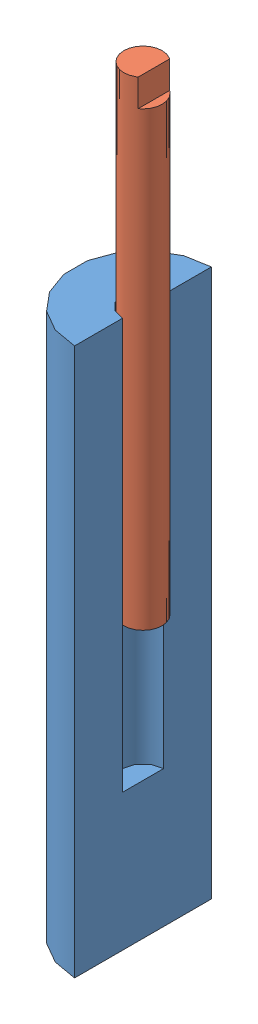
SolidWorks assembly Limit Mate Assy.SLDASM, configuration Default (file format 3400). Lengths in mm.
Overall size (32 277.44 50).
3 component instances, 2 part files, 4 mates.
Components (placement in the parent):
- cylinder-1: cylinder.SLDPRT [Default] at origin size (25 200 50)
- piston-1: piston.SLDPRT [Default] at (0 102.4407 0) x (-1 0 0) z (0 1 0) size (14 14 175)
- cylinder-2: cylinder.SLDPRT [Default] at (21.6506 0 -12.5) x (-0.5 0 0.866025) z (-0.866025 0 -0.5) size (25 200 50) (hidden)
Mates (geometry in assembly coordinates):
- Concentric1: concentric anti-aligned: cylinder of cylinder-1; cylinder of piston-1
- Coincident1: coincident aligned: plane of cylinder-1 through (0 0 0) normal (0 -1 0); plane of ? through (24.5577 0 -29.6817) normal (0 -1 0)
- Coincident2: coincident aligned: line of cylinder-1; line of ?
- Parallel1: parallel aligned: plane of cylinder-1 through (0 0 -25) normal (1 0 0); plane of piston-1 through (4 267.4407 -17.2853) normal (1 0 0)
